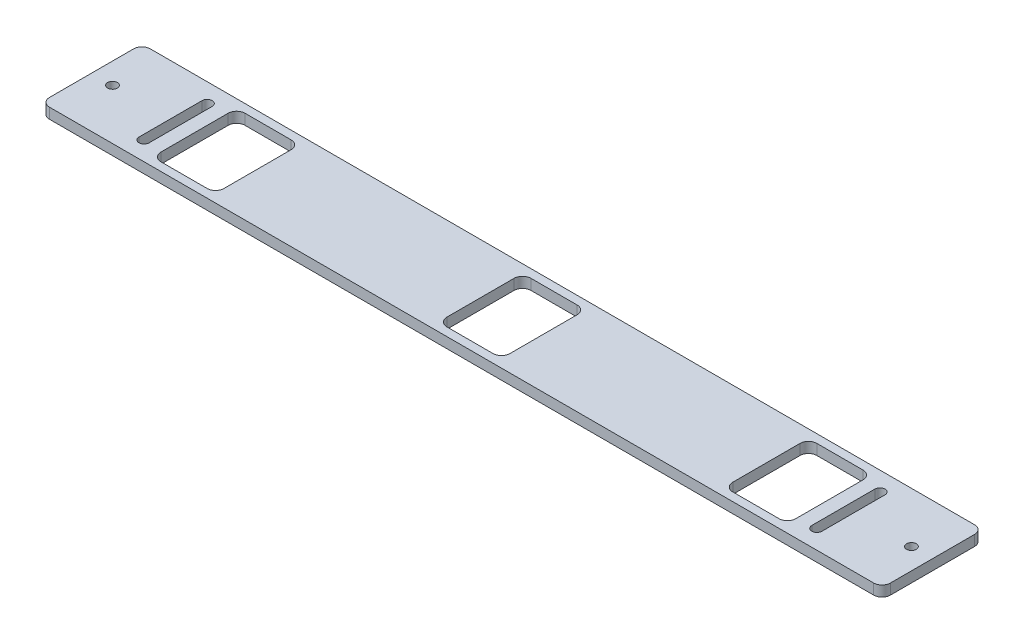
ISO-10303-21;
HEADER;
FILE_DESCRIPTION(('STEP AP214'),'2;1');
FILE_NAME('part.step','',(''),(''),'','','');
FILE_SCHEMA(('AUTOMOTIVE_DESIGN { 1 0 10303 214 1 1 1 1 }'));
ENDSEC;
DATA;
#1=APPLICATION_CONTEXT('core data for automotive mechanical design processes');
#2=APPLICATION_PROTOCOL_DEFINITION('international standard','automotive_design',2000,#1);
#3=PRODUCT_CONTEXT('',#1,'mechanical');
#4=PRODUCT('Part','Part','',(#3));
#5=PRODUCT_RELATED_PRODUCT_CATEGORY('part','',(#4));
#6=PRODUCT_DEFINITION_FORMATION('','',#4);
#7=PRODUCT_DEFINITION_CONTEXT('part definition',#1,'design');
#8=PRODUCT_DEFINITION('design','',#6,#7);
#9=PRODUCT_DEFINITION_SHAPE('','',#8);
#10=(LENGTH_UNIT() NAMED_UNIT(*) SI_UNIT(.MILLI.,.METRE.));
#11=(NAMED_UNIT(*) PLANE_ANGLE_UNIT() SI_UNIT($,.RADIAN.));
#12=(NAMED_UNIT(*) SI_UNIT($,.STERADIAN.) SOLID_ANGLE_UNIT());
#13=UNCERTAINTY_MEASURE_WITH_UNIT(LENGTH_MEASURE(1.E-05),#10,'distance_accuracy_value','');
#14=(GEOMETRIC_REPRESENTATION_CONTEXT(3) GLOBAL_UNCERTAINTY_ASSIGNED_CONTEXT((#13)) GLOBAL_UNIT_ASSIGNED_CONTEXT((#10,
#11,#12)) REPRESENTATION_CONTEXT('',''));
#15=CARTESIAN_POINT('',(0.,0.,0.));
#16=DIRECTION('',(0.,0.,1.));
#17=DIRECTION('',(1.,0.,0.));
#18=AXIS2_PLACEMENT_3D('',#15,#16,#17);
#19=CARTESIAN_POINT('',(0.,3.175,0.));
#20=DIRECTION('',(0.,-1.,0.));
#21=DIRECTION('',(0.,0.,-1.));
#22=AXIS2_PLACEMENT_3D('',#19,#20,#21);
#23=PLANE('',#22);
#24=CARTESIAN_POINT('',(6.35,3.175,-15.24));
#25=DIRECTION('',(0.,1.,0.));
#26=DIRECTION('',(0.,0.,1.));
#27=AXIS2_PLACEMENT_3D('',#24,#25,#26);
#28=CIRCLE('',#27,1.47319999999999);
#29=CARTESIAN_POINT('',(6.35,3.175,-13.7668));
#30=VERTEX_POINT('',#29);
#31=EDGE_CURVE('E1129',#30,#30,#28,.T.);
#32=ORIENTED_EDGE('',*,*,#31,.F.);
#33=EDGE_LOOP('',(#32));
#34=FACE_BOUND('',#33,.T.);
#35=CARTESIAN_POINT('',(247.65,3.175,-15.24));
#36=DIRECTION('',(0.,1.,0.));
#37=DIRECTION('',(0.,0.,1.));
#38=AXIS2_PLACEMENT_3D('',#35,#36,#37);
#39=CIRCLE('',#38,1.47319999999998);
#40=CARTESIAN_POINT('',(247.65,3.175,-13.7668));
#41=VERTEX_POINT('',#40);
#42=EDGE_CURVE('E1131',#41,#41,#39,.T.);
#43=ORIENTED_EDGE('',*,*,#42,.F.);
#44=EDGE_LOOP('',(#43));
#45=FACE_BOUND('',#44,.T.);
#46=CARTESIAN_POINT('',(25.4,3.175,-5.715));
#47=DIRECTION('',(0.,1.,0.));
#48=DIRECTION('',(0.,0.,1.));
#49=AXIS2_PLACEMENT_3D('',#46,#47,#48);
#50=CIRCLE('',#49,1.524);
#51=CARTESIAN_POINT('',(23.876,3.175,-5.715));
#52=VERTEX_POINT('',#51);
#53=CARTESIAN_POINT('',(26.924,3.175,-5.715));
#54=VERTEX_POINT('',#53);
#55=EDGE_CURVE('E335',#52,#54,#50,.T.);
#56=ORIENTED_EDGE('',*,*,#55,.F.);
#57=DIRECTION('',(0.,0.,1.));
#58=VECTOR('',#57,1.);
#59=CARTESIAN_POINT('',(23.876,3.175,-5.715));
#60=LINE('',#59,#58);
#61=CARTESIAN_POINT('',(23.876,3.175,-24.765));
#62=VERTEX_POINT('',#61);
#63=EDGE_CURVE('E343',#62,#52,#60,.T.);
#64=ORIENTED_EDGE('',*,*,#63,.F.);
#65=CARTESIAN_POINT('',(25.4,3.175,-24.765));
#66=DIRECTION('',(0.,1.,0.));
#67=DIRECTION('',(0.,0.,1.));
#68=AXIS2_PLACEMENT_3D('',#65,#66,#67);
#69=CIRCLE('',#68,1.524);
#70=CARTESIAN_POINT('',(26.924,3.175,-24.765));
#71=VERTEX_POINT('',#70);
#72=EDGE_CURVE('E340',#71,#62,#69,.T.);
#73=ORIENTED_EDGE('',*,*,#72,.F.);
#74=DIRECTION('',(0.,0.,-1.));
#75=VECTOR('',#74,1.);
#76=CARTESIAN_POINT('',(26.924,3.175,-5.715));
#77=LINE('',#76,#75);
#78=EDGE_CURVE('E337',#54,#71,#77,.T.);
#79=ORIENTED_EDGE('',*,*,#78,.F.);
#80=EDGE_LOOP('',(#56,#64,#73,#79));
#81=FACE_BOUND('',#80,.T.);
#82=DIRECTION('',(0.,0.,1.));
#83=VECTOR('',#82,1.);
#84=CARTESIAN_POINT('',(117.475,3.175,-27.94));
#85=LINE('',#84,#83);
#86=CARTESIAN_POINT('',(117.475,3.175,-25.4));
#87=VERTEX_POINT('',#86);
#88=CARTESIAN_POINT('',(117.475,3.175,-5.08));
#89=VERTEX_POINT('',#88);
#90=EDGE_CURVE('E389',#87,#89,#85,.T.);
#91=ORIENTED_EDGE('',*,*,#90,.F.);
#92=CARTESIAN_POINT('',(120.015,3.175,-25.4));
#93=DIRECTION('',(0.,-1.,0.));
#94=DIRECTION('',(0.,0.,-1.));
#95=AXIS2_PLACEMENT_3D('',#92,#93,#94);
#96=CIRCLE('',#95,2.54);
#97=CARTESIAN_POINT('',(120.015,3.175,-27.94));
#98=VERTEX_POINT('',#97);
#99=EDGE_CURVE('E576',#87,#98,#96,.T.);
#100=ORIENTED_EDGE('',*,*,#99,.T.);
#101=DIRECTION('',(-1.,0.,0.));
#102=VECTOR('',#101,1.);
#103=CARTESIAN_POINT('',(117.475,3.175,-27.94));
#104=LINE('',#103,#102);
#105=CARTESIAN_POINT('',(133.985,3.175,-27.94));
#106=VERTEX_POINT('',#105);
#107=EDGE_CURVE('E399',#106,#98,#104,.T.);
#108=ORIENTED_EDGE('',*,*,#107,.F.);
#109=CARTESIAN_POINT('',(133.985,3.175,-25.4));
#110=DIRECTION('',(0.,-1.,0.));
#111=DIRECTION('',(0.,0.,-1.));
#112=AXIS2_PLACEMENT_3D('',#109,#110,#111);
#113=CIRCLE('',#112,2.54);
#114=CARTESIAN_POINT('',(136.525,3.175,-25.4));
#115=VERTEX_POINT('',#114);
#116=EDGE_CURVE('E572',#106,#115,#113,.T.);
#117=ORIENTED_EDGE('',*,*,#116,.T.);
#118=DIRECTION('',(0.,0.,-1.));
#119=VECTOR('',#118,1.);
#120=CARTESIAN_POINT('',(136.525,3.175,-27.94));
#121=LINE('',#120,#119);
#122=CARTESIAN_POINT('',(136.525,3.175,-5.08));
#123=VERTEX_POINT('',#122);
#124=EDGE_CURVE('E396',#123,#115,#121,.T.);
#125=ORIENTED_EDGE('',*,*,#124,.F.);
#126=CARTESIAN_POINT('',(133.985,3.175,-5.08));
#127=DIRECTION('',(0.,-1.,0.));
#128=DIRECTION('',(0.,0.,-1.));
#129=AXIS2_PLACEMENT_3D('',#126,#127,#128);
#130=CIRCLE('',#129,2.54);
#131=CARTESIAN_POINT('',(133.985,3.175,-2.54));
#132=VERTEX_POINT('',#131);
#133=EDGE_CURVE('E584',#123,#132,#130,.T.);
#134=ORIENTED_EDGE('',*,*,#133,.T.);
#135=DIRECTION('',(1.,0.,0.));
#136=VECTOR('',#135,1.);
#137=CARTESIAN_POINT('',(117.475,3.175,-2.54));
#138=LINE('',#137,#136);
#139=CARTESIAN_POINT('',(120.015,3.175,-2.54));
#140=VERTEX_POINT('',#139);
#141=EDGE_CURVE('E392',#140,#132,#138,.T.);
#142=ORIENTED_EDGE('',*,*,#141,.F.);
#143=CARTESIAN_POINT('',(120.015,3.175,-5.08));
#144=DIRECTION('',(0.,-1.,0.));
#145=DIRECTION('',(0.,0.,-1.));
#146=AXIS2_PLACEMENT_3D('',#143,#144,#145);
#147=CIRCLE('',#146,2.54);
#148=EDGE_CURVE('E580',#140,#89,#147,.T.);
#149=ORIENTED_EDGE('',*,*,#148,.T.);
#150=EDGE_LOOP('',(#91,#100,#108,#117,#125,#134,#142,#149));
#151=FACE_BOUND('',#150,.T.);
#152=DIRECTION('',(1.,0.,0.));
#153=VECTOR('',#152,1.);
#154=CARTESIAN_POINT('',(0.,3.175,0.));
#155=LINE('',#154,#153);
#156=CARTESIAN_POINT('',(2.54,3.175,0.));
#157=VERTEX_POINT('',#156);
#158=CARTESIAN_POINT('',(251.46,3.175,0.));
#159=VERTEX_POINT('',#158);
#160=EDGE_CURVE('E440',#157,#159,#155,.T.);
#161=ORIENTED_EDGE('',*,*,#160,.T.);
#162=CARTESIAN_POINT('',(251.46,3.175,-2.54));
#163=DIRECTION('',(0.,-1.,0.));
#164=DIRECTION('',(0.,0.,-1.));
#165=AXIS2_PLACEMENT_3D('',#162,#163,#164);
#166=CIRCLE('',#165,2.54);
#167=CARTESIAN_POINT('',(254.,3.175,-2.54));
#168=VERTEX_POINT('',#167);
#169=EDGE_CURVE('E484',#159,#168,#166,.F.);
#170=ORIENTED_EDGE('',*,*,#169,.T.);
#171=DIRECTION('',(0.,0.,-1.));
#172=VECTOR('',#171,1.);
#173=CARTESIAN_POINT('',(254.,3.175,0.));
#174=LINE('',#173,#172);
#175=CARTESIAN_POINT('',(254.,3.175,-27.94));
#176=VERTEX_POINT('',#175);
#177=EDGE_CURVE('E444',#168,#176,#174,.T.);
#178=ORIENTED_EDGE('',*,*,#177,.T.);
#179=CARTESIAN_POINT('',(251.46,3.175,-27.94));
#180=DIRECTION('',(0.,-1.,0.));
#181=DIRECTION('',(0.,0.,-1.));
#182=AXIS2_PLACEMENT_3D('',#179,#180,#181);
#183=CIRCLE('',#182,2.54);
#184=CARTESIAN_POINT('',(251.46,3.175,-30.48));
#185=VERTEX_POINT('',#184);
#186=EDGE_CURVE('E482',#176,#185,#183,.F.);
#187=ORIENTED_EDGE('',*,*,#186,.T.);
#188=DIRECTION('',(-1.,0.,0.));
#189=VECTOR('',#188,1.);
#190=CARTESIAN_POINT('',(0.,3.175,-30.48));
#191=LINE('',#190,#189);
#192=CARTESIAN_POINT('',(2.54,3.175,-30.48));
#193=VERTEX_POINT('',#192);
#194=EDGE_CURVE('E447',#185,#193,#191,.T.);
#195=ORIENTED_EDGE('',*,*,#194,.T.);
#196=CARTESIAN_POINT('',(2.54,3.175,-27.94));
#197=DIRECTION('',(0.,-1.,0.));
#198=DIRECTION('',(0.,0.,-1.));
#199=AXIS2_PLACEMENT_3D('',#196,#197,#198);
#200=CIRCLE('',#199,2.54);
#201=CARTESIAN_POINT('',(0.,3.175,-27.94));
#202=VERTEX_POINT('',#201);
#203=EDGE_CURVE('E478',#193,#202,#200,.F.);
#204=ORIENTED_EDGE('',*,*,#203,.T.);
#205=DIRECTION('',(0.,0.,1.));
#206=VECTOR('',#205,1.);
#207=CARTESIAN_POINT('',(0.,3.175,0.));
#208=LINE('',#207,#206);
#209=CARTESIAN_POINT('',(0.,3.175,-2.54));
#210=VERTEX_POINT('',#209);
#211=EDGE_CURVE('E437',#202,#210,#208,.T.);
#212=ORIENTED_EDGE('',*,*,#211,.T.);
#213=CARTESIAN_POINT('',(2.54,3.175,-2.54));
#214=DIRECTION('',(0.,-1.,0.));
#215=DIRECTION('',(0.,0.,-1.));
#216=AXIS2_PLACEMENT_3D('',#213,#214,#215);
#217=CIRCLE('',#216,2.54);
#218=EDGE_CURVE('E480',#210,#157,#217,.F.);
#219=ORIENTED_EDGE('',*,*,#218,.T.);
#220=EDGE_LOOP('',(#161,#170,#178,#187,#195,#204,#212,#219));
#221=FACE_BOUND('',#220,.T.);
#222=DIRECTION('',(0.,0.,1.));
#223=VECTOR('',#222,1.);
#224=CARTESIAN_POINT('',(31.115,3.175,-27.94));
#225=LINE('',#224,#223);
#226=CARTESIAN_POINT('',(31.115,3.175,-25.4));
#227=VERTEX_POINT('',#226);
#228=CARTESIAN_POINT('',(31.115,3.175,-5.08));
#229=VERTEX_POINT('',#228);
#230=EDGE_CURVE('E413',#227,#229,#225,.T.);
#231=ORIENTED_EDGE('',*,*,#230,.F.);
#232=CARTESIAN_POINT('',(33.655,3.175,-25.4));
#233=DIRECTION('',(0.,-1.,0.));
#234=DIRECTION('',(0.,0.,-1.));
#235=AXIS2_PLACEMENT_3D('',#232,#233,#234);
#236=CIRCLE('',#235,2.54);
#237=CARTESIAN_POINT('',(33.655,3.175,-27.94));
#238=VERTEX_POINT('',#237);
#239=EDGE_CURVE('E11',#227,#238,#236,.T.);
#240=ORIENTED_EDGE('',*,*,#239,.T.);
#241=DIRECTION('',(-1.,0.,0.));
#242=VECTOR('',#241,1.);
#243=CARTESIAN_POINT('',(31.115,3.175,-27.94));
#244=LINE('',#243,#242);
#245=CARTESIAN_POINT('',(47.625,3.175,-27.94));
#246=VERTEX_POINT('',#245);
#247=EDGE_CURVE('E423',#246,#238,#244,.T.);
#248=ORIENTED_EDGE('',*,*,#247,.F.);
#249=CARTESIAN_POINT('',(47.625,3.175,-25.4));
#250=DIRECTION('',(0.,-1.,0.));
#251=DIRECTION('',(0.,0.,-1.));
#252=AXIS2_PLACEMENT_3D('',#249,#250,#251);
#253=CIRCLE('',#252,2.54);
#254=CARTESIAN_POINT('',(50.165,3.175,-25.4));
#255=VERTEX_POINT('',#254);
#256=EDGE_CURVE('E596',#246,#255,#253,.T.);
#257=ORIENTED_EDGE('',*,*,#256,.T.);
#258=DIRECTION('',(0.,0.,-1.));
#259=VECTOR('',#258,1.);
#260=CARTESIAN_POINT('',(50.165,3.175,-27.94));
#261=LINE('',#260,#259);
#262=CARTESIAN_POINT('',(50.165,3.175,-5.08));
#263=VERTEX_POINT('',#262);
#264=EDGE_CURVE('E420',#263,#255,#261,.T.);
#265=ORIENTED_EDGE('',*,*,#264,.F.);
#266=CARTESIAN_POINT('',(47.625,3.175,-5.08));
#267=DIRECTION('',(0.,-1.,0.));
#268=DIRECTION('',(0.,0.,-1.));
#269=AXIS2_PLACEMENT_3D('',#266,#267,#268);
#270=CIRCLE('',#269,2.54);
#271=CARTESIAN_POINT('',(47.625,3.175,-2.54));
#272=VERTEX_POINT('',#271);
#273=EDGE_CURVE('E588',#263,#272,#270,.T.);
#274=ORIENTED_EDGE('',*,*,#273,.T.);
#275=DIRECTION('',(1.,0.,0.));
#276=VECTOR('',#275,1.);
#277=CARTESIAN_POINT('',(31.115,3.175,-2.54));
#278=LINE('',#277,#276);
#279=CARTESIAN_POINT('',(33.655,3.175,-2.54));
#280=VERTEX_POINT('',#279);
#281=EDGE_CURVE('E416',#280,#272,#278,.T.);
#282=ORIENTED_EDGE('',*,*,#281,.F.);
#283=CARTESIAN_POINT('',(33.655,3.175,-5.08));
#284=DIRECTION('',(0.,-1.,0.));
#285=DIRECTION('',(0.,0.,-1.));
#286=AXIS2_PLACEMENT_3D('',#283,#284,#285);
#287=CIRCLE('',#286,2.54);
#288=EDGE_CURVE('E592',#280,#229,#287,.T.);
#289=ORIENTED_EDGE('',*,*,#288,.T.);
#290=EDGE_LOOP('',(#231,#240,#248,#257,#265,#274,#282,#289));
#291=FACE_BOUND('',#290,.T.);
#292=DIRECTION('',(0.,0.,1.));
#293=VECTOR('',#292,1.);
#294=CARTESIAN_POINT('',(203.835,3.175,-27.94));
#295=LINE('',#294,#293);
#296=CARTESIAN_POINT('',(203.835,3.175,-25.4));
#297=VERTEX_POINT('',#296);
#298=CARTESIAN_POINT('',(203.835,3.175,-5.08));
#299=VERTEX_POINT('',#298);
#300=EDGE_CURVE('E366',#297,#299,#295,.T.);
#301=ORIENTED_EDGE('',*,*,#300,.F.);
#302=CARTESIAN_POINT('',(206.375,3.175,-25.4));
#303=DIRECTION('',(0.,-1.,0.));
#304=DIRECTION('',(0.,0.,-1.));
#305=AXIS2_PLACEMENT_3D('',#302,#303,#304);
#306=CIRCLE('',#305,2.54);
#307=CARTESIAN_POINT('',(206.375,3.175,-27.94));
#308=VERTEX_POINT('',#307);
#309=EDGE_CURVE('E557',#297,#308,#306,.T.);
#310=ORIENTED_EDGE('',*,*,#309,.T.);
#311=DIRECTION('',(-1.,0.,0.));
#312=VECTOR('',#311,1.);
#313=CARTESIAN_POINT('',(203.835,3.175,-27.94));
#314=LINE('',#313,#312);
#315=CARTESIAN_POINT('',(220.345,3.175,-27.94));
#316=VERTEX_POINT('',#315);
#317=EDGE_CURVE('E375',#316,#308,#314,.T.);
#318=ORIENTED_EDGE('',*,*,#317,.F.);
#319=CARTESIAN_POINT('',(220.345,3.175,-25.4));
#320=DIRECTION('',(0.,-1.,0.));
#321=DIRECTION('',(0.,0.,-1.));
#322=AXIS2_PLACEMENT_3D('',#319,#320,#321);
#323=CIRCLE('',#322,2.54);
#324=CARTESIAN_POINT('',(222.885,3.175,-25.4));
#325=VERTEX_POINT('',#324);
#326=EDGE_CURVE('E568',#316,#325,#323,.T.);
#327=ORIENTED_EDGE('',*,*,#326,.T.);
#328=DIRECTION('',(0.,0.,-1.));
#329=VECTOR('',#328,1.);
#330=CARTESIAN_POINT('',(222.885,3.175,-27.94));
#331=LINE('',#330,#329);
#332=CARTESIAN_POINT('',(222.885,3.175,-5.08));
#333=VERTEX_POINT('',#332);
#334=EDGE_CURVE('E372',#333,#325,#331,.T.);
#335=ORIENTED_EDGE('',*,*,#334,.F.);
#336=CARTESIAN_POINT('',(220.345,3.175,-5.08));
#337=DIRECTION('',(0.,-1.,0.));
#338=DIRECTION('',(0.,0.,-1.));
#339=AXIS2_PLACEMENT_3D('',#336,#337,#338);
#340=CIRCLE('',#339,2.54);
#341=CARTESIAN_POINT('',(220.345,3.175,-2.54));
#342=VERTEX_POINT('',#341);
#343=EDGE_CURVE('E48',#333,#342,#340,.T.);
#344=ORIENTED_EDGE('',*,*,#343,.T.);
#345=DIRECTION('',(1.,0.,0.));
#346=VECTOR('',#345,1.);
#347=CARTESIAN_POINT('',(203.835,3.175,-2.54));
#348=LINE('',#347,#346);
#349=CARTESIAN_POINT('',(206.375,3.175,-2.54));
#350=VERTEX_POINT('',#349);
#351=EDGE_CURVE('E369',#350,#342,#348,.T.);
#352=ORIENTED_EDGE('',*,*,#351,.F.);
#353=CARTESIAN_POINT('',(206.375,3.175,-5.08));
#354=DIRECTION('',(0.,-1.,0.));
#355=DIRECTION('',(0.,0.,-1.));
#356=AXIS2_PLACEMENT_3D('',#353,#354,#355);
#357=CIRCLE('',#356,2.54);
#358=EDGE_CURVE('E561',#350,#299,#357,.T.);
#359=ORIENTED_EDGE('',*,*,#358,.T.);
#360=EDGE_LOOP('',(#301,#310,#318,#327,#335,#344,#352,#359));
#361=FACE_BOUND('',#360,.T.);
#362=CARTESIAN_POINT('',(228.6,3.175,-5.71500000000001));
#363=DIRECTION('',(0.,1.,0.));
#364=DIRECTION('',(0.,0.,-1.));
#365=AXIS2_PLACEMENT_3D('',#362,#363,#364);
#366=CIRCLE('',#365,1.524);
#367=CARTESIAN_POINT('',(227.076,3.175,-5.71500000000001));
#368=VERTEX_POINT('',#367);
#369=CARTESIAN_POINT('',(230.124,3.175,-5.71500000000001));
#370=VERTEX_POINT('',#369);
#371=EDGE_CURVE('E292',#368,#370,#366,.T.);
#372=ORIENTED_EDGE('',*,*,#371,.F.);
#373=DIRECTION('',(0.,0.,1.));
#374=VECTOR('',#373,1.);
#375=CARTESIAN_POINT('',(227.076,3.175,-5.71500000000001));
#376=LINE('',#375,#374);
#377=CARTESIAN_POINT('',(227.076,3.175,-24.765));
#378=VERTEX_POINT('',#377);
#379=EDGE_CURVE('E317',#378,#368,#376,.T.);
#380=ORIENTED_EDGE('',*,*,#379,.F.);
#381=CARTESIAN_POINT('',(228.6,3.175,-24.765));
#382=DIRECTION('',(0.,1.,0.));
#383=DIRECTION('',(0.,0.,-1.));
#384=AXIS2_PLACEMENT_3D('',#381,#382,#383);
#385=CIRCLE('',#384,1.524);
#386=CARTESIAN_POINT('',(230.124,3.175,-24.765));
#387=VERTEX_POINT('',#386);
#388=EDGE_CURVE('E315',#387,#378,#385,.T.);
#389=ORIENTED_EDGE('',*,*,#388,.F.);
#390=DIRECTION('',(0.,0.,-1.));
#391=VECTOR('',#390,1.);
#392=CARTESIAN_POINT('',(230.124,3.175,-5.71500000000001));
#393=LINE('',#392,#391);
#394=EDGE_CURVE('E302',#370,#387,#393,.T.);
#395=ORIENTED_EDGE('',*,*,#394,.F.);
#396=EDGE_LOOP('',(#372,#380,#389,#395));
#397=FACE_BOUND('',#396,.T.);
#398=ADVANCED_FACE('F33',(#34,#45,#81,#151,#221,#291,#361,#397),#23,.F.);
#399=CARTESIAN_POINT('',(0.,0.,0.));
#400=DIRECTION('',(0.,-1.,0.));
#401=DIRECTION('',(0.,0.,-1.));
#402=AXIS2_PLACEMENT_3D('',#399,#400,#401);
#403=PLANE('',#402);
#404=CARTESIAN_POINT('',(6.35,0.,-15.24));
#405=DIRECTION('',(0.,1.,0.));
#406=DIRECTION('',(0.,0.,1.));
#407=AXIS2_PLACEMENT_3D('',#404,#405,#406);
#408=CIRCLE('',#407,1.4732);
#409=CARTESIAN_POINT('',(6.35,0.,-13.7668));
#410=VERTEX_POINT('',#409);
#411=EDGE_CURVE('E1127',#410,#410,#408,.T.);
#412=ORIENTED_EDGE('',*,*,#411,.T.);
#413=EDGE_LOOP('',(#412));
#414=FACE_BOUND('',#413,.T.);
#415=CARTESIAN_POINT('',(247.65,0.,-15.24));
#416=DIRECTION('',(0.,1.,0.));
#417=DIRECTION('',(0.,0.,1.));
#418=AXIS2_PLACEMENT_3D('',#415,#416,#417);
#419=CIRCLE('',#418,1.47320000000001);
#420=CARTESIAN_POINT('',(247.65,0.,-13.7668));
#421=VERTEX_POINT('',#420);
#422=EDGE_CURVE('E324',#421,#421,#419,.T.);
#423=ORIENTED_EDGE('',*,*,#422,.T.);
#424=EDGE_LOOP('',(#423));
#425=FACE_BOUND('',#424,.T.);
#426=DIRECTION('',(0.,0.,1.));
#427=VECTOR('',#426,1.);
#428=CARTESIAN_POINT('',(23.876,0.,-5.715));
#429=LINE('',#428,#427);
#430=CARTESIAN_POINT('',(23.876,0.,-24.765));
#431=VERTEX_POINT('',#430);
#432=CARTESIAN_POINT('',(23.876,0.,-5.715));
#433=VERTEX_POINT('',#432);
#434=EDGE_CURVE('E338',#431,#433,#429,.T.);
#435=ORIENTED_EDGE('',*,*,#434,.T.);
#436=CARTESIAN_POINT('',(25.4,0.,-5.715));
#437=DIRECTION('',(0.,1.,0.));
#438=DIRECTION('',(0.,0.,1.));
#439=AXIS2_PLACEMENT_3D('',#436,#437,#438);
#440=CIRCLE('',#439,1.524);
#441=CARTESIAN_POINT('',(26.924,0.,-5.715));
#442=VERTEX_POINT('',#441);
#443=EDGE_CURVE('E310',#433,#442,#440,.T.);
#444=ORIENTED_EDGE('',*,*,#443,.T.);
#445=DIRECTION('',(0.,0.,-1.));
#446=VECTOR('',#445,1.);
#447=CARTESIAN_POINT('',(26.924,0.,-5.715));
#448=LINE('',#447,#446);
#449=CARTESIAN_POINT('',(26.924,0.,-24.765));
#450=VERTEX_POINT('',#449);
#451=EDGE_CURVE('E348',#442,#450,#448,.T.);
#452=ORIENTED_EDGE('',*,*,#451,.T.);
#453=CARTESIAN_POINT('',(25.4,0.,-24.765));
#454=DIRECTION('',(0.,1.,0.));
#455=DIRECTION('',(0.,0.,1.));
#456=AXIS2_PLACEMENT_3D('',#453,#454,#455);
#457=CIRCLE('',#456,1.524);
#458=EDGE_CURVE('E351',#450,#431,#457,.T.);
#459=ORIENTED_EDGE('',*,*,#458,.T.);
#460=EDGE_LOOP('',(#435,#444,#452,#459));
#461=FACE_BOUND('',#460,.T.);
#462=DIRECTION('',(0.,0.,-1.));
#463=VECTOR('',#462,1.);
#464=CARTESIAN_POINT('',(136.525,0.,-27.94));
#465=LINE('',#464,#463);
#466=CARTESIAN_POINT('',(136.525,0.,-5.08));
#467=VERTEX_POINT('',#466);
#468=CARTESIAN_POINT('',(136.525,0.,-25.4));
#469=VERTEX_POINT('',#468);
#470=EDGE_CURVE('E408',#467,#469,#465,.T.);
#471=ORIENTED_EDGE('',*,*,#470,.T.);
#472=CARTESIAN_POINT('',(133.985,0.,-25.4));
#473=DIRECTION('',(0.,-1.,0.));
#474=DIRECTION('',(0.,0.,-1.));
#475=AXIS2_PLACEMENT_3D('',#472,#473,#474);
#476=CIRCLE('',#475,2.54);
#477=CARTESIAN_POINT('',(133.985,0.,-27.94));
#478=VERTEX_POINT('',#477);
#479=EDGE_CURVE('E570',#469,#478,#476,.F.);
#480=ORIENTED_EDGE('',*,*,#479,.T.);
#481=DIRECTION('',(-1.,0.,0.));
#482=VECTOR('',#481,1.);
#483=CARTESIAN_POINT('',(117.475,0.,-27.94));
#484=LINE('',#483,#482);
#485=CARTESIAN_POINT('',(120.015,0.,-27.94));
#486=VERTEX_POINT('',#485);
#487=EDGE_CURVE('E393',#478,#486,#484,.T.);
#488=ORIENTED_EDGE('',*,*,#487,.T.);
#489=CARTESIAN_POINT('',(120.015,0.,-25.4));
#490=DIRECTION('',(0.,-1.,0.));
#491=DIRECTION('',(0.,0.,-1.));
#492=AXIS2_PLACEMENT_3D('',#489,#490,#491);
#493=CIRCLE('',#492,2.54);
#494=CARTESIAN_POINT('',(117.475,0.,-25.4));
#495=VERTEX_POINT('',#494);
#496=EDGE_CURVE('E574',#486,#495,#493,.F.);
#497=ORIENTED_EDGE('',*,*,#496,.T.);
#498=DIRECTION('',(0.,0.,1.));
#499=VECTOR('',#498,1.);
#500=CARTESIAN_POINT('',(117.475,0.,-27.94));
#501=LINE('',#500,#499);
#502=CARTESIAN_POINT('',(117.475,0.,-5.08));
#503=VERTEX_POINT('',#502);
#504=EDGE_CURVE('E378',#495,#503,#501,.T.);
#505=ORIENTED_EDGE('',*,*,#504,.T.);
#506=CARTESIAN_POINT('',(120.015,0.,-5.08));
#507=DIRECTION('',(0.,-1.,0.));
#508=DIRECTION('',(0.,0.,-1.));
#509=AXIS2_PLACEMENT_3D('',#506,#507,#508);
#510=CIRCLE('',#509,2.54);
#511=CARTESIAN_POINT('',(120.015,0.,-2.54));
#512=VERTEX_POINT('',#511);
#513=EDGE_CURVE('E578',#503,#512,#510,.F.);
#514=ORIENTED_EDGE('',*,*,#513,.T.);
#515=DIRECTION('',(1.,0.,0.));
#516=VECTOR('',#515,1.);
#517=CARTESIAN_POINT('',(117.475,0.,-2.54));
#518=LINE('',#517,#516);
#519=CARTESIAN_POINT('',(133.985,0.,-2.54));
#520=VERTEX_POINT('',#519);
#521=EDGE_CURVE('E405',#512,#520,#518,.T.);
#522=ORIENTED_EDGE('',*,*,#521,.T.);
#523=CARTESIAN_POINT('',(133.985,0.,-5.08));
#524=DIRECTION('',(0.,-1.,0.));
#525=DIRECTION('',(0.,0.,-1.));
#526=AXIS2_PLACEMENT_3D('',#523,#524,#525);
#527=CIRCLE('',#526,2.54);
#528=EDGE_CURVE('E582',#520,#467,#527,.F.);
#529=ORIENTED_EDGE('',*,*,#528,.T.);
#530=EDGE_LOOP('',(#471,#480,#488,#497,#505,#514,#522,#529));
#531=FACE_BOUND('',#530,.T.);
#532=DIRECTION('',(0.,0.,-1.));
#533=VECTOR('',#532,1.);
#534=CARTESIAN_POINT('',(254.,0.,0.));
#535=LINE('',#534,#533);
#536=CARTESIAN_POINT('',(254.,0.,-2.54));
#537=VERTEX_POINT('',#536);
#538=CARTESIAN_POINT('',(254.,0.,-27.94));
#539=VERTEX_POINT('',#538);
#540=EDGE_CURVE('E456',#537,#539,#535,.T.);
#541=ORIENTED_EDGE('',*,*,#540,.F.);
#542=CARTESIAN_POINT('',(251.46,0.,-2.54));
#543=DIRECTION('',(0.,-1.,0.));
#544=DIRECTION('',(0.,0.,-1.));
#545=AXIS2_PLACEMENT_3D('',#542,#543,#544);
#546=CIRCLE('',#545,2.54);
#547=CARTESIAN_POINT('',(251.46,0.,0.));
#548=VERTEX_POINT('',#547);
#549=EDGE_CURVE('E471',#537,#548,#546,.T.);
#550=ORIENTED_EDGE('',*,*,#549,.T.);
#551=DIRECTION('',(1.,0.,0.));
#552=VECTOR('',#551,1.);
#553=CARTESIAN_POINT('',(0.,0.,0.));
#554=LINE('',#553,#552);
#555=CARTESIAN_POINT('',(2.54,0.,0.));
#556=VERTEX_POINT('',#555);
#557=EDGE_CURVE('E453',#556,#548,#554,.T.);
#558=ORIENTED_EDGE('',*,*,#557,.F.);
#559=CARTESIAN_POINT('',(2.54,0.,-2.54));
#560=DIRECTION('',(0.,-1.,0.));
#561=DIRECTION('',(0.,0.,-1.));
#562=AXIS2_PLACEMENT_3D('',#559,#560,#561);
#563=CIRCLE('',#562,2.54);
#564=CARTESIAN_POINT('',(0.,0.,-2.54));
#565=VERTEX_POINT('',#564);
#566=EDGE_CURVE('E467',#556,#565,#563,.T.);
#567=ORIENTED_EDGE('',*,*,#566,.T.);
#568=DIRECTION('',(0.,0.,1.));
#569=VECTOR('',#568,1.);
#570=CARTESIAN_POINT('',(0.,0.,0.));
#571=LINE('',#570,#569);
#572=CARTESIAN_POINT('',(0.,0.,-27.94));
#573=VERTEX_POINT('',#572);
#574=EDGE_CURVE('E426',#573,#565,#571,.T.);
#575=ORIENTED_EDGE('',*,*,#574,.F.);
#576=CARTESIAN_POINT('',(2.54,0.,-27.94));
#577=DIRECTION('',(0.,-1.,0.));
#578=DIRECTION('',(0.,0.,-1.));
#579=AXIS2_PLACEMENT_3D('',#576,#577,#578);
#580=CIRCLE('',#579,2.54);
#581=CARTESIAN_POINT('',(2.54,0.,-30.48));
#582=VERTEX_POINT('',#581);
#583=EDGE_CURVE('E465',#573,#582,#580,.T.);
#584=ORIENTED_EDGE('',*,*,#583,.T.);
#585=DIRECTION('',(-1.,0.,0.));
#586=VECTOR('',#585,1.);
#587=CARTESIAN_POINT('',(0.,0.,-30.48));
#588=LINE('',#587,#586);
#589=CARTESIAN_POINT('',(251.46,0.,-30.48));
#590=VERTEX_POINT('',#589);
#591=EDGE_CURVE('E441',#590,#582,#588,.T.);
#592=ORIENTED_EDGE('',*,*,#591,.F.);
#593=CARTESIAN_POINT('',(251.46,0.,-27.94));
#594=DIRECTION('',(0.,-1.,0.));
#595=DIRECTION('',(0.,0.,-1.));
#596=AXIS2_PLACEMENT_3D('',#593,#594,#595);
#597=CIRCLE('',#596,2.54);
#598=EDGE_CURVE('E469',#590,#539,#597,.T.);
#599=ORIENTED_EDGE('',*,*,#598,.T.);
#600=EDGE_LOOP('',(#541,#550,#558,#567,#575,#584,#592,#599));
#601=FACE_BOUND('',#600,.T.);
#602=DIRECTION('',(0.,0.,-1.));
#603=VECTOR('',#602,1.);
#604=CARTESIAN_POINT('',(50.165,0.,-27.94));
#605=LINE('',#604,#603);
#606=CARTESIAN_POINT('',(50.165,0.,-5.08));
#607=VERTEX_POINT('',#606);
#608=CARTESIAN_POINT('',(50.165,0.,-25.4));
#609=VERTEX_POINT('',#608);
#610=EDGE_CURVE('E432',#607,#609,#605,.T.);
#611=ORIENTED_EDGE('',*,*,#610,.T.);
#612=CARTESIAN_POINT('',(47.625,0.,-25.4));
#613=DIRECTION('',(0.,-1.,0.));
#614=DIRECTION('',(0.,0.,-1.));
#615=AXIS2_PLACEMENT_3D('',#612,#613,#614);
#616=CIRCLE('',#615,2.54);
#617=CARTESIAN_POINT('',(47.625,0.,-27.94));
#618=VERTEX_POINT('',#617);
#619=EDGE_CURVE('E594',#609,#618,#616,.F.);
#620=ORIENTED_EDGE('',*,*,#619,.T.);
#621=DIRECTION('',(-1.,0.,0.));
#622=VECTOR('',#621,1.);
#623=CARTESIAN_POINT('',(31.115,0.,-27.94));
#624=LINE('',#623,#622);
#625=CARTESIAN_POINT('',(33.655,0.,-27.94));
#626=VERTEX_POINT('',#625);
#627=EDGE_CURVE('E417',#618,#626,#624,.T.);
#628=ORIENTED_EDGE('',*,*,#627,.T.);
#629=CARTESIAN_POINT('',(33.655,0.,-25.4));
#630=DIRECTION('',(0.,-1.,0.));
#631=DIRECTION('',(0.,0.,-1.));
#632=AXIS2_PLACEMENT_3D('',#629,#630,#631);
#633=CIRCLE('',#632,2.54);
#634=CARTESIAN_POINT('',(31.115,0.,-25.4));
#635=VERTEX_POINT('',#634);
#636=EDGE_CURVE('E41',#626,#635,#633,.F.);
#637=ORIENTED_EDGE('',*,*,#636,.T.);
#638=DIRECTION('',(0.,0.,1.));
#639=VECTOR('',#638,1.);
#640=CARTESIAN_POINT('',(31.115,0.,-27.94));
#641=LINE('',#640,#639);
#642=CARTESIAN_POINT('',(31.115,0.,-5.08));
#643=VERTEX_POINT('',#642);
#644=EDGE_CURVE('E402',#635,#643,#641,.T.);
#645=ORIENTED_EDGE('',*,*,#644,.T.);
#646=CARTESIAN_POINT('',(33.655,0.,-5.08));
#647=DIRECTION('',(0.,-1.,0.));
#648=DIRECTION('',(0.,0.,-1.));
#649=AXIS2_PLACEMENT_3D('',#646,#647,#648);
#650=CIRCLE('',#649,2.54);
#651=CARTESIAN_POINT('',(33.655,0.,-2.54));
#652=VERTEX_POINT('',#651);
#653=EDGE_CURVE('E590',#643,#652,#650,.F.);
#654=ORIENTED_EDGE('',*,*,#653,.T.);
#655=DIRECTION('',(1.,0.,0.));
#656=VECTOR('',#655,1.);
#657=CARTESIAN_POINT('',(31.115,0.,-2.54));
#658=LINE('',#657,#656);
#659=CARTESIAN_POINT('',(47.625,0.,-2.54));
#660=VERTEX_POINT('',#659);
#661=EDGE_CURVE('E429',#652,#660,#658,.T.);
#662=ORIENTED_EDGE('',*,*,#661,.T.);
#663=CARTESIAN_POINT('',(47.625,0.,-5.08));
#664=DIRECTION('',(0.,-1.,0.));
#665=DIRECTION('',(0.,0.,-1.));
#666=AXIS2_PLACEMENT_3D('',#663,#664,#665);
#667=CIRCLE('',#666,2.54);
#668=EDGE_CURVE('E586',#660,#607,#667,.F.);
#669=ORIENTED_EDGE('',*,*,#668,.T.);
#670=EDGE_LOOP('',(#611,#620,#628,#637,#645,#654,#662,#669));
#671=FACE_BOUND('',#670,.T.);
#672=DIRECTION('',(0.,0.,-1.));
#673=VECTOR('',#672,1.);
#674=CARTESIAN_POINT('',(222.885,0.,-27.94));
#675=LINE('',#674,#673);
#676=CARTESIAN_POINT('',(222.885,0.,-5.08));
#677=VERTEX_POINT('',#676);
#678=CARTESIAN_POINT('',(222.885,0.,-25.4));
#679=VERTEX_POINT('',#678);
#680=EDGE_CURVE('E384',#677,#679,#675,.T.);
#681=ORIENTED_EDGE('',*,*,#680,.T.);
#682=CARTESIAN_POINT('',(220.345,0.,-25.4));
#683=DIRECTION('',(0.,-1.,0.));
#684=DIRECTION('',(0.,0.,-1.));
#685=AXIS2_PLACEMENT_3D('',#682,#683,#684);
#686=CIRCLE('',#685,2.54);
#687=CARTESIAN_POINT('',(220.345,0.,-27.94));
#688=VERTEX_POINT('',#687);
#689=EDGE_CURVE('E566',#679,#688,#686,.F.);
#690=ORIENTED_EDGE('',*,*,#689,.T.);
#691=DIRECTION('',(-1.,0.,0.));
#692=VECTOR('',#691,1.);
#693=CARTESIAN_POINT('',(203.835,0.,-27.94));
#694=LINE('',#693,#692);
#695=CARTESIAN_POINT('',(206.375,0.,-27.94));
#696=VERTEX_POINT('',#695);
#697=EDGE_CURVE('E370',#688,#696,#694,.T.);
#698=ORIENTED_EDGE('',*,*,#697,.T.);
#699=CARTESIAN_POINT('',(206.375,0.,-25.4));
#700=DIRECTION('',(0.,-1.,0.));
#701=DIRECTION('',(0.,0.,-1.));
#702=AXIS2_PLACEMENT_3D('',#699,#700,#701);
#703=CIRCLE('',#702,2.54);
#704=CARTESIAN_POINT('',(203.835,0.,-25.4));
#705=VERTEX_POINT('',#704);
#706=EDGE_CURVE('E555',#696,#705,#703,.F.);
#707=ORIENTED_EDGE('',*,*,#706,.T.);
#708=DIRECTION('',(0.,0.,1.));
#709=VECTOR('',#708,1.);
#710=CARTESIAN_POINT('',(203.835,0.,-27.94));
#711=LINE('',#710,#709);
#712=CARTESIAN_POINT('',(203.835,0.,-5.08));
#713=VERTEX_POINT('',#712);
#714=EDGE_CURVE('E365',#705,#713,#711,.T.);
#715=ORIENTED_EDGE('',*,*,#714,.T.);
#716=CARTESIAN_POINT('',(206.375,0.,-5.08));
#717=DIRECTION('',(0.,-1.,0.));
#718=DIRECTION('',(0.,0.,-1.));
#719=AXIS2_PLACEMENT_3D('',#716,#717,#718);
#720=CIRCLE('',#719,2.54);
#721=CARTESIAN_POINT('',(206.375,0.,-2.54));
#722=VERTEX_POINT('',#721);
#723=EDGE_CURVE('E559',#713,#722,#720,.F.);
#724=ORIENTED_EDGE('',*,*,#723,.T.);
#725=DIRECTION('',(1.,0.,0.));
#726=VECTOR('',#725,1.);
#727=CARTESIAN_POINT('',(203.835,0.,-2.54));
#728=LINE('',#727,#726);
#729=CARTESIAN_POINT('',(220.345,0.,-2.54));
#730=VERTEX_POINT('',#729);
#731=EDGE_CURVE('E381',#722,#730,#728,.T.);
#732=ORIENTED_EDGE('',*,*,#731,.T.);
#733=CARTESIAN_POINT('',(220.345,0.,-5.08));
#734=DIRECTION('',(0.,-1.,0.));
#735=DIRECTION('',(0.,0.,-1.));
#736=AXIS2_PLACEMENT_3D('',#733,#734,#735);
#737=CIRCLE('',#736,2.54);
#738=EDGE_CURVE('E563',#730,#677,#737,.F.);
#739=ORIENTED_EDGE('',*,*,#738,.T.);
#740=EDGE_LOOP('',(#681,#690,#698,#707,#715,#724,#732,#739));
#741=FACE_BOUND('',#740,.T.);
#742=DIRECTION('',(0.,0.,1.));
#743=VECTOR('',#742,1.);
#744=CARTESIAN_POINT('',(227.076,0.,-5.71500000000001));
#745=LINE('',#744,#743);
#746=CARTESIAN_POINT('',(227.076,0.,-24.765));
#747=VERTEX_POINT('',#746);
#748=CARTESIAN_POINT('',(227.076,0.,-5.71500000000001));
#749=VERTEX_POINT('',#748);
#750=EDGE_CURVE('E303',#747,#749,#745,.T.);
#751=ORIENTED_EDGE('',*,*,#750,.T.);
#752=CARTESIAN_POINT('',(228.6,0.,-5.71500000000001));
#753=DIRECTION('',(0.,1.,0.));
#754=DIRECTION('',(0.,0.,-1.));
#755=AXIS2_PLACEMENT_3D('',#752,#753,#754);
#756=CIRCLE('',#755,1.524);
#757=CARTESIAN_POINT('',(230.124,0.,-5.71500000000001));
#758=VERTEX_POINT('',#757);
#759=EDGE_CURVE('E322',#749,#758,#756,.T.);
#760=ORIENTED_EDGE('',*,*,#759,.T.);
#761=DIRECTION('',(0.,0.,-1.));
#762=VECTOR('',#761,1.);
#763=CARTESIAN_POINT('',(230.124,0.,-5.71500000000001));
#764=LINE('',#763,#762);
#765=CARTESIAN_POINT('',(230.124,0.,-24.765));
#766=VERTEX_POINT('',#765);
#767=EDGE_CURVE('E309',#758,#766,#764,.T.);
#768=ORIENTED_EDGE('',*,*,#767,.T.);
#769=CARTESIAN_POINT('',(228.6,0.,-24.765));
#770=DIRECTION('',(0.,1.,0.));
#771=DIRECTION('',(0.,0.,-1.));
#772=AXIS2_PLACEMENT_3D('',#769,#770,#771);
#773=CIRCLE('',#772,1.524);
#774=EDGE_CURVE('E326',#766,#747,#773,.T.);
#775=ORIENTED_EDGE('',*,*,#774,.T.);
#776=EDGE_LOOP('',(#751,#760,#768,#775));
#777=FACE_BOUND('',#776,.T.);
#778=ADVANCED_FACE('F599',(#414,#425,#461,#531,#601,#671,#741,#777),#403,.T.);
#779=CARTESIAN_POINT('',(0.,3.175,0.));
#780=DIRECTION('',(1.,0.,0.));
#781=DIRECTION('',(0.,0.,-1.));
#782=AXIS2_PLACEMENT_3D('',#779,#780,#781);
#783=PLANE('',#782);
#784=ORIENTED_EDGE('',*,*,#574,.T.);
#785=DIRECTION('',(0.,-1.,0.));
#786=VECTOR('',#785,1.);
#787=CARTESIAN_POINT('',(0.,3.175,-2.54));
#788=LINE('',#787,#786);
#789=EDGE_CURVE('E494',#565,#210,#788,.F.);
#790=ORIENTED_EDGE('',*,*,#789,.T.);
#791=ORIENTED_EDGE('',*,*,#211,.F.);
#792=DIRECTION('',(0.,-1.,0.));
#793=VECTOR('',#792,1.);
#794=CARTESIAN_POINT('',(0.,3.175,-27.94));
#795=LINE('',#794,#793);
#796=EDGE_CURVE('E491',#202,#573,#795,.T.);
#797=ORIENTED_EDGE('',*,*,#796,.T.);
#798=EDGE_LOOP('',(#784,#790,#791,#797));
#799=FACE_BOUND('',#798,.T.);
#800=ADVANCED_FACE('F650',(#799),#783,.F.);
#801=CARTESIAN_POINT('',(0.,3.175,0.));
#802=DIRECTION('',(0.,0.,-1.));
#803=DIRECTION('',(-1.,0.,0.));
#804=AXIS2_PLACEMENT_3D('',#801,#802,#803);
#805=PLANE('',#804);
#806=ORIENTED_EDGE('',*,*,#557,.T.);
#807=DIRECTION('',(0.,-1.,0.));
#808=VECTOR('',#807,1.);
#809=CARTESIAN_POINT('',(251.46,3.175,0.));
#810=LINE('',#809,#808);
#811=EDGE_CURVE('E476',#548,#159,#810,.F.);
#812=ORIENTED_EDGE('',*,*,#811,.T.);
#813=ORIENTED_EDGE('',*,*,#160,.F.);
#814=DIRECTION('',(0.,-1.,0.));
#815=VECTOR('',#814,1.);
#816=CARTESIAN_POINT('',(2.54,3.175,0.));
#817=LINE('',#816,#815);
#818=EDGE_CURVE('E473',#157,#556,#817,.T.);
#819=ORIENTED_EDGE('',*,*,#818,.T.);
#820=EDGE_LOOP('',(#806,#812,#813,#819));
#821=FACE_BOUND('',#820,.T.);
#822=ADVANCED_FACE('F665',(#821),#805,.F.);
#823=CARTESIAN_POINT('',(254.,3.175,0.));
#824=DIRECTION('',(-1.,0.,0.));
#825=DIRECTION('',(0.,0.,1.));
#826=AXIS2_PLACEMENT_3D('',#823,#824,#825);
#827=PLANE('',#826);
#828=ORIENTED_EDGE('',*,*,#177,.F.);
#829=DIRECTION('',(0.,-1.,0.));
#830=VECTOR('',#829,1.);
#831=CARTESIAN_POINT('',(254.,3.175,-2.54));
#832=LINE('',#831,#830);
#833=EDGE_CURVE('E462',#168,#537,#832,.T.);
#834=ORIENTED_EDGE('',*,*,#833,.T.);
#835=ORIENTED_EDGE('',*,*,#540,.T.);
#836=DIRECTION('',(0.,-1.,0.));
#837=VECTOR('',#836,1.);
#838=CARTESIAN_POINT('',(254.,3.175,-27.94));
#839=LINE('',#838,#837);
#840=EDGE_CURVE('E450',#539,#176,#839,.F.);
#841=ORIENTED_EDGE('',*,*,#840,.T.);
#842=EDGE_LOOP('',(#828,#834,#835,#841));
#843=FACE_BOUND('',#842,.T.);
#844=ADVANCED_FACE('F661',(#843),#827,.F.);
#845=CARTESIAN_POINT('',(0.,3.175,-30.48));
#846=DIRECTION('',(0.,0.,1.));
#847=DIRECTION('',(1.,0.,0.));
#848=AXIS2_PLACEMENT_3D('',#845,#846,#847);
#849=PLANE('',#848);
#850=ORIENTED_EDGE('',*,*,#194,.F.);
#851=DIRECTION('',(0.,-1.,0.));
#852=VECTOR('',#851,1.);
#853=CARTESIAN_POINT('',(251.46,3.175,-30.48));
#854=LINE('',#853,#852);
#855=EDGE_CURVE('E488',#185,#590,#854,.T.);
#856=ORIENTED_EDGE('',*,*,#855,.T.);
#857=ORIENTED_EDGE('',*,*,#591,.T.);
#858=DIRECTION('',(0.,-1.,0.));
#859=VECTOR('',#858,1.);
#860=CARTESIAN_POINT('',(2.54,3.175,-30.48));
#861=LINE('',#860,#859);
#862=EDGE_CURVE('E486',#582,#193,#861,.F.);
#863=ORIENTED_EDGE('',*,*,#862,.T.);
#864=EDGE_LOOP('',(#850,#856,#857,#863));
#865=FACE_BOUND('',#864,.T.);
#866=ADVANCED_FACE('F658',(#865),#849,.F.);
#867=CARTESIAN_POINT('',(31.115,3.175,-27.94));
#868=DIRECTION('',(1.,0.,0.));
#869=DIRECTION('',(0.,0.,-1.));
#870=AXIS2_PLACEMENT_3D('',#867,#868,#869);
#871=PLANE('',#870);
#872=ORIENTED_EDGE('',*,*,#230,.T.);
#873=DIRECTION('',(0.,-1.,0.));
#874=VECTOR('',#873,1.);
#875=CARTESIAN_POINT('',(31.115,0.,-5.08));
#876=LINE('',#875,#874);
#877=EDGE_CURVE('E547',#229,#643,#876,.T.);
#878=ORIENTED_EDGE('',*,*,#877,.T.);
#879=ORIENTED_EDGE('',*,*,#644,.F.);
#880=DIRECTION('',(0.,-1.,0.));
#881=VECTOR('',#880,1.);
#882=CARTESIAN_POINT('',(31.115,3.175,-25.4));
#883=LINE('',#882,#881);
#884=EDGE_CURVE('E545',#635,#227,#883,.F.);
#885=ORIENTED_EDGE('',*,*,#884,.T.);
#886=EDGE_LOOP('',(#872,#878,#879,#885));
#887=FACE_BOUND('',#886,.T.);
#888=ADVANCED_FACE('F606',(#887),#871,.T.);
#889=CARTESIAN_POINT('',(31.115,3.175,-2.54));
#890=DIRECTION('',(0.,0.,-1.));
#891=DIRECTION('',(-1.,0.,0.));
#892=AXIS2_PLACEMENT_3D('',#889,#890,#891);
#893=PLANE('',#892);
#894=ORIENTED_EDGE('',*,*,#281,.T.);
#895=DIRECTION('',(0.,-1.,0.));
#896=VECTOR('',#895,1.);
#897=CARTESIAN_POINT('',(47.625,0.,-2.54));
#898=LINE('',#897,#896);
#899=EDGE_CURVE('E537',#272,#660,#898,.T.);
#900=ORIENTED_EDGE('',*,*,#899,.T.);
#901=ORIENTED_EDGE('',*,*,#661,.F.);
#902=DIRECTION('',(0.,-1.,0.));
#903=VECTOR('',#902,1.);
#904=CARTESIAN_POINT('',(33.655,3.175,-2.54));
#905=LINE('',#904,#903);
#906=EDGE_CURVE('E535',#652,#280,#905,.F.);
#907=ORIENTED_EDGE('',*,*,#906,.T.);
#908=EDGE_LOOP('',(#894,#900,#901,#907));
#909=FACE_BOUND('',#908,.T.);
#910=ADVANCED_FACE('F631',(#909),#893,.T.);
#911=CARTESIAN_POINT('',(50.165,3.175,-27.94));
#912=DIRECTION('',(-1.,0.,0.));
#913=DIRECTION('',(0.,0.,1.));
#914=AXIS2_PLACEMENT_3D('',#911,#912,#913);
#915=PLANE('',#914);
#916=ORIENTED_EDGE('',*,*,#610,.F.);
#917=DIRECTION('',(0.,-1.,0.));
#918=VECTOR('',#917,1.);
#919=CARTESIAN_POINT('',(50.165,3.175,-5.08));
#920=LINE('',#919,#918);
#921=EDGE_CURVE('E543',#607,#263,#920,.F.);
#922=ORIENTED_EDGE('',*,*,#921,.T.);
#923=ORIENTED_EDGE('',*,*,#264,.T.);
#924=DIRECTION('',(0.,-1.,0.));
#925=VECTOR('',#924,1.);
#926=CARTESIAN_POINT('',(50.165,0.,-25.4));
#927=LINE('',#926,#925);
#928=EDGE_CURVE('E540',#255,#609,#927,.T.);
#929=ORIENTED_EDGE('',*,*,#928,.T.);
#930=EDGE_LOOP('',(#916,#922,#923,#929));
#931=FACE_BOUND('',#930,.T.);
#932=ADVANCED_FACE('F623',(#931),#915,.T.);
#933=CARTESIAN_POINT('',(31.115,3.175,-27.94));
#934=DIRECTION('',(0.,0.,1.));
#935=DIRECTION('',(1.,0.,0.));
#936=AXIS2_PLACEMENT_3D('',#933,#934,#935);
#937=PLANE('',#936);
#938=ORIENTED_EDGE('',*,*,#627,.F.);
#939=DIRECTION('',(0.,-1.,0.));
#940=VECTOR('',#939,1.);
#941=CARTESIAN_POINT('',(47.625,3.175,-27.94));
#942=LINE('',#941,#940);
#943=EDGE_CURVE('E553',#618,#246,#942,.F.);
#944=ORIENTED_EDGE('',*,*,#943,.T.);
#945=ORIENTED_EDGE('',*,*,#247,.T.);
#946=DIRECTION('',(0.,-1.,0.));
#947=VECTOR('',#946,1.);
#948=CARTESIAN_POINT('',(33.655,0.,-27.94));
#949=LINE('',#948,#947);
#950=EDGE_CURVE('E550',#238,#626,#949,.T.);
#951=ORIENTED_EDGE('',*,*,#950,.T.);
#952=EDGE_LOOP('',(#938,#944,#945,#951));
#953=FACE_BOUND('',#952,.T.);
#954=ADVANCED_FACE('F614',(#953),#937,.T.);
#955=CARTESIAN_POINT('',(117.475,3.175,-27.94));
#956=DIRECTION('',(1.,0.,0.));
#957=DIRECTION('',(0.,0.,-1.));
#958=AXIS2_PLACEMENT_3D('',#955,#956,#957);
#959=PLANE('',#958);
#960=ORIENTED_EDGE('',*,*,#504,.F.);
#961=DIRECTION('',(0.,-1.,0.));
#962=VECTOR('',#961,1.);
#963=CARTESIAN_POINT('',(117.475,3.175,-25.4));
#964=LINE('',#963,#962);
#965=EDGE_CURVE('E528',#495,#87,#964,.F.);
#966=ORIENTED_EDGE('',*,*,#965,.T.);
#967=ORIENTED_EDGE('',*,*,#90,.T.);
#968=DIRECTION('',(0.,-1.,0.));
#969=VECTOR('',#968,1.);
#970=CARTESIAN_POINT('',(117.475,0.,-5.08));
#971=LINE('',#970,#969);
#972=EDGE_CURVE('E525',#89,#503,#971,.T.);
#973=ORIENTED_EDGE('',*,*,#972,.T.);
#974=EDGE_LOOP('',(#960,#966,#967,#973));
#975=FACE_BOUND('',#974,.T.);
#976=ADVANCED_FACE('F739',(#975),#959,.T.);
#977=CARTESIAN_POINT('',(117.475,3.175,-2.54));
#978=DIRECTION('',(0.,0.,-1.));
#979=DIRECTION('',(-1.,0.,0.));
#980=AXIS2_PLACEMENT_3D('',#977,#978,#979);
#981=PLANE('',#980);
#982=ORIENTED_EDGE('',*,*,#521,.F.);
#983=DIRECTION('',(0.,-1.,0.));
#984=VECTOR('',#983,1.);
#985=CARTESIAN_POINT('',(120.015,3.175,-2.54));
#986=LINE('',#985,#984);
#987=EDGE_CURVE('E533',#512,#140,#986,.F.);
#988=ORIENTED_EDGE('',*,*,#987,.T.);
#989=ORIENTED_EDGE('',*,*,#141,.T.);
#990=DIRECTION('',(0.,-1.,0.));
#991=VECTOR('',#990,1.);
#992=CARTESIAN_POINT('',(133.985,0.,-2.54));
#993=LINE('',#992,#991);
#994=EDGE_CURVE('E530',#132,#520,#993,.T.);
#995=ORIENTED_EDGE('',*,*,#994,.T.);
#996=EDGE_LOOP('',(#982,#988,#989,#995));
#997=FACE_BOUND('',#996,.T.);
#998=ADVANCED_FACE('F733',(#997),#981,.T.);
#999=CARTESIAN_POINT('',(136.525,3.175,-27.94));
#1000=DIRECTION('',(-1.,0.,0.));
#1001=DIRECTION('',(0.,0.,1.));
#1002=AXIS2_PLACEMENT_3D('',#999,#1000,#1001);
#1003=PLANE('',#1002);
#1004=ORIENTED_EDGE('',*,*,#124,.T.);
#1005=DIRECTION('',(0.,-1.,0.));
#1006=VECTOR('',#1005,1.);
#1007=CARTESIAN_POINT('',(136.525,0.,-25.4));
#1008=LINE('',#1007,#1006);
#1009=EDGE_CURVE('E517',#115,#469,#1008,.T.);
#1010=ORIENTED_EDGE('',*,*,#1009,.T.);
#1011=ORIENTED_EDGE('',*,*,#470,.F.);
#1012=DIRECTION('',(0.,-1.,0.));
#1013=VECTOR('',#1012,1.);
#1014=CARTESIAN_POINT('',(136.525,3.175,-5.08));
#1015=LINE('',#1014,#1013);
#1016=EDGE_CURVE('E515',#467,#123,#1015,.F.);
#1017=ORIENTED_EDGE('',*,*,#1016,.T.);
#1018=EDGE_LOOP('',(#1004,#1010,#1011,#1017));
#1019=FACE_BOUND('',#1018,.T.);
#1020=ADVANCED_FACE('F750',(#1019),#1003,.T.);
#1021=CARTESIAN_POINT('',(117.475,3.175,-27.94));
#1022=DIRECTION('',(0.,0.,1.));
#1023=DIRECTION('',(1.,0.,0.));
#1024=AXIS2_PLACEMENT_3D('',#1021,#1022,#1023);
#1025=PLANE('',#1024);
#1026=ORIENTED_EDGE('',*,*,#487,.F.);
#1027=DIRECTION('',(0.,-1.,0.));
#1028=VECTOR('',#1027,1.);
#1029=CARTESIAN_POINT('',(133.985,3.175,-27.94));
#1030=LINE('',#1029,#1028);
#1031=EDGE_CURVE('E523',#478,#106,#1030,.F.);
#1032=ORIENTED_EDGE('',*,*,#1031,.T.);
#1033=ORIENTED_EDGE('',*,*,#107,.T.);
#1034=DIRECTION('',(0.,-1.,0.));
#1035=VECTOR('',#1034,1.);
#1036=CARTESIAN_POINT('',(120.015,0.,-27.94));
#1037=LINE('',#1036,#1035);
#1038=EDGE_CURVE('E520',#98,#486,#1037,.T.);
#1039=ORIENTED_EDGE('',*,*,#1038,.T.);
#1040=EDGE_LOOP('',(#1026,#1032,#1033,#1039));
#1041=FACE_BOUND('',#1040,.T.);
#1042=ADVANCED_FACE('F746',(#1041),#1025,.T.);
#1043=CARTESIAN_POINT('',(203.835,3.175,-27.94));
#1044=DIRECTION('',(1.,0.,0.));
#1045=DIRECTION('',(0.,0.,-1.));
#1046=AXIS2_PLACEMENT_3D('',#1043,#1044,#1045);
#1047=PLANE('',#1046);
#1048=ORIENTED_EDGE('',*,*,#714,.F.);
#1049=DIRECTION('',(0.,-1.,0.));
#1050=VECTOR('',#1049,1.);
#1051=CARTESIAN_POINT('',(203.835,3.175,-25.4));
#1052=LINE('',#1051,#1050);
#1053=EDGE_CURVE('E504',#705,#297,#1052,.F.);
#1054=ORIENTED_EDGE('',*,*,#1053,.T.);
#1055=ORIENTED_EDGE('',*,*,#300,.T.);
#1056=DIRECTION('',(0.,-1.,0.));
#1057=VECTOR('',#1056,1.);
#1058=CARTESIAN_POINT('',(203.835,0.,-5.08));
#1059=LINE('',#1058,#1057);
#1060=EDGE_CURVE('E501',#299,#713,#1059,.T.);
#1061=ORIENTED_EDGE('',*,*,#1060,.T.);
#1062=EDGE_LOOP('',(#1048,#1054,#1055,#1061));
#1063=FACE_BOUND('',#1062,.T.);
#1064=ADVANCED_FACE('F780',(#1063),#1047,.T.);
#1065=CARTESIAN_POINT('',(203.835,3.175,-2.54));
#1066=DIRECTION('',(0.,0.,-1.));
#1067=DIRECTION('',(-1.,0.,0.));
#1068=AXIS2_PLACEMENT_3D('',#1065,#1066,#1067);
#1069=PLANE('',#1068);
#1070=ORIENTED_EDGE('',*,*,#731,.F.);
#1071=DIRECTION('',(0.,-1.,0.));
#1072=VECTOR('',#1071,1.);
#1073=CARTESIAN_POINT('',(206.375,3.175,-2.54));
#1074=LINE('',#1073,#1072);
#1075=EDGE_CURVE('E55',#722,#350,#1074,.F.);
#1076=ORIENTED_EDGE('',*,*,#1075,.T.);
#1077=ORIENTED_EDGE('',*,*,#351,.T.);
#1078=DIRECTION('',(0.,-1.,0.));
#1079=VECTOR('',#1078,1.);
#1080=CARTESIAN_POINT('',(220.345,0.,-2.54));
#1081=LINE('',#1080,#1079);
#1082=EDGE_CURVE('E506',#342,#730,#1081,.T.);
#1083=ORIENTED_EDGE('',*,*,#1082,.T.);
#1084=EDGE_LOOP('',(#1070,#1076,#1077,#1083));
#1085=FACE_BOUND('',#1084,.T.);
#1086=ADVANCED_FACE('F883',(#1085),#1069,.T.);
#1087=CARTESIAN_POINT('',(222.885,3.175,-27.94));
#1088=DIRECTION('',(-1.,0.,0.));
#1089=DIRECTION('',(0.,0.,1.));
#1090=AXIS2_PLACEMENT_3D('',#1087,#1088,#1089);
#1091=PLANE('',#1090);
#1092=ORIENTED_EDGE('',*,*,#680,.F.);
#1093=DIRECTION('',(0.,-1.,0.));
#1094=VECTOR('',#1093,1.);
#1095=CARTESIAN_POINT('',(222.885,3.175,-5.08));
#1096=LINE('',#1095,#1094);
#1097=EDGE_CURVE('E513',#677,#333,#1096,.F.);
#1098=ORIENTED_EDGE('',*,*,#1097,.T.);
#1099=ORIENTED_EDGE('',*,*,#334,.T.);
#1100=DIRECTION('',(0.,-1.,0.));
#1101=VECTOR('',#1100,1.);
#1102=CARTESIAN_POINT('',(222.885,0.,-25.4));
#1103=LINE('',#1102,#1101);
#1104=EDGE_CURVE('E510',#325,#679,#1103,.T.);
#1105=ORIENTED_EDGE('',*,*,#1104,.T.);
#1106=EDGE_LOOP('',(#1092,#1098,#1099,#1105));
#1107=FACE_BOUND('',#1106,.T.);
#1108=ADVANCED_FACE('F879',(#1107),#1091,.T.);
#1109=CARTESIAN_POINT('',(203.835,3.175,-27.94));
#1110=DIRECTION('',(0.,0.,1.));
#1111=DIRECTION('',(1.,0.,0.));
#1112=AXIS2_PLACEMENT_3D('',#1109,#1110,#1111);
#1113=PLANE('',#1112);
#1114=ORIENTED_EDGE('',*,*,#317,.T.);
#1115=DIRECTION('',(0.,-1.,0.));
#1116=VECTOR('',#1115,1.);
#1117=CARTESIAN_POINT('',(206.375,0.,-27.94));
#1118=LINE('',#1117,#1116);
#1119=EDGE_CURVE('E498',#308,#696,#1118,.T.);
#1120=ORIENTED_EDGE('',*,*,#1119,.T.);
#1121=ORIENTED_EDGE('',*,*,#697,.F.);
#1122=DIRECTION('',(0.,-1.,0.));
#1123=VECTOR('',#1122,1.);
#1124=CARTESIAN_POINT('',(220.345,3.175,-27.94));
#1125=LINE('',#1124,#1123);
#1126=EDGE_CURVE('E496',#688,#316,#1125,.F.);
#1127=ORIENTED_EDGE('',*,*,#1126,.T.);
#1128=EDGE_LOOP('',(#1114,#1120,#1121,#1127));
#1129=FACE_BOUND('',#1128,.T.);
#1130=ADVANCED_FACE('F875',(#1129),#1113,.T.);
#1131=CARTESIAN_POINT('',(25.4,3.175,-5.715));
#1132=DIRECTION('',(0.,-1.,0.));
#1133=DIRECTION('',(0.,0.,-1.));
#1134=AXIS2_PLACEMENT_3D('',#1131,#1132,#1133);
#1135=CYLINDRICAL_SURFACE('',#1134,1.524);
#1136=ORIENTED_EDGE('',*,*,#443,.F.);
#1137=DIRECTION('',(0.,-1.,0.));
#1138=VECTOR('',#1137,1.);
#1139=CARTESIAN_POINT('',(23.876,3.175,-5.715));
#1140=LINE('',#1139,#1138);
#1141=EDGE_CURVE('E345',#52,#433,#1140,.T.);
#1142=ORIENTED_EDGE('',*,*,#1141,.F.);
#1143=ORIENTED_EDGE('',*,*,#55,.T.);
#1144=DIRECTION('',(0.,-1.,0.));
#1145=VECTOR('',#1144,1.);
#1146=CARTESIAN_POINT('',(26.924,3.175,-5.715));
#1147=LINE('',#1146,#1145);
#1148=EDGE_CURVE('E362',#54,#442,#1147,.T.);
#1149=ORIENTED_EDGE('',*,*,#1148,.T.);
#1150=EDGE_LOOP('',(#1136,#1142,#1143,#1149));
#1151=FACE_BOUND('',#1150,.T.);
#1152=ADVANCED_FACE('F871',(#1151),#1135,.F.);
#1153=CARTESIAN_POINT('',(26.924,3.175,-5.715));
#1154=DIRECTION('',(-1.,0.,0.));
#1155=DIRECTION('',(0.,0.,1.));
#1156=AXIS2_PLACEMENT_3D('',#1153,#1154,#1155);
#1157=PLANE('',#1156);
#1158=ORIENTED_EDGE('',*,*,#451,.F.);
#1159=ORIENTED_EDGE('',*,*,#1148,.F.);
#1160=ORIENTED_EDGE('',*,*,#78,.T.);
#1161=DIRECTION('',(0.,-1.,0.));
#1162=VECTOR('',#1161,1.);
#1163=CARTESIAN_POINT('',(26.924,3.175,-24.765));
#1164=LINE('',#1163,#1162);
#1165=EDGE_CURVE('E360',#71,#450,#1164,.T.);
#1166=ORIENTED_EDGE('',*,*,#1165,.T.);
#1167=EDGE_LOOP('',(#1158,#1159,#1160,#1166));
#1168=FACE_BOUND('',#1167,.T.);
#1169=ADVANCED_FACE('F867',(#1168),#1157,.T.);
#1170=CARTESIAN_POINT('',(25.4,3.175,-24.765));
#1171=DIRECTION('',(0.,-1.,0.));
#1172=DIRECTION('',(0.,0.,-1.));
#1173=AXIS2_PLACEMENT_3D('',#1170,#1171,#1172);
#1174=CYLINDRICAL_SURFACE('',#1173,1.524);
#1175=ORIENTED_EDGE('',*,*,#458,.F.);
#1176=ORIENTED_EDGE('',*,*,#1165,.F.);
#1177=ORIENTED_EDGE('',*,*,#72,.T.);
#1178=DIRECTION('',(0.,-1.,0.));
#1179=VECTOR('',#1178,1.);
#1180=CARTESIAN_POINT('',(23.876,3.175,-24.765));
#1181=LINE('',#1180,#1179);
#1182=EDGE_CURVE('E358',#62,#431,#1181,.T.);
#1183=ORIENTED_EDGE('',*,*,#1182,.T.);
#1184=EDGE_LOOP('',(#1175,#1176,#1177,#1183));
#1185=FACE_BOUND('',#1184,.T.);
#1186=ADVANCED_FACE('F863',(#1185),#1174,.F.);
#1187=CARTESIAN_POINT('',(23.876,3.175,-5.715));
#1188=DIRECTION('',(1.,0.,0.));
#1189=DIRECTION('',(0.,0.,-1.));
#1190=AXIS2_PLACEMENT_3D('',#1187,#1188,#1189);
#1191=PLANE('',#1190);
#1192=ORIENTED_EDGE('',*,*,#434,.F.);
#1193=ORIENTED_EDGE('',*,*,#1182,.F.);
#1194=ORIENTED_EDGE('',*,*,#63,.T.);
#1195=ORIENTED_EDGE('',*,*,#1141,.T.);
#1196=EDGE_LOOP('',(#1192,#1193,#1194,#1195));
#1197=FACE_BOUND('',#1196,.T.);
#1198=ADVANCED_FACE('F860',(#1197),#1191,.T.);
#1199=CARTESIAN_POINT('',(228.6,3.175,-5.71500000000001));
#1200=DIRECTION('',(0.,-1.,0.));
#1201=DIRECTION('',(0.,0.,-1.));
#1202=AXIS2_PLACEMENT_3D('',#1199,#1200,#1201);
#1203=CYLINDRICAL_SURFACE('',#1202,1.524);
#1204=ORIENTED_EDGE('',*,*,#759,.F.);
#1205=DIRECTION('',(0.,-1.,0.));
#1206=VECTOR('',#1205,1.);
#1207=CARTESIAN_POINT('',(227.076,3.175,-5.71500000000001));
#1208=LINE('',#1207,#1206);
#1209=EDGE_CURVE('E298',#368,#749,#1208,.T.);
#1210=ORIENTED_EDGE('',*,*,#1209,.F.);
#1211=ORIENTED_EDGE('',*,*,#371,.T.);
#1212=DIRECTION('',(0.,-1.,0.));
#1213=VECTOR('',#1212,1.);
#1214=CARTESIAN_POINT('',(230.124,3.175,-5.71500000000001));
#1215=LINE('',#1214,#1213);
#1216=EDGE_CURVE('E295',#370,#758,#1215,.T.);
#1217=ORIENTED_EDGE('',*,*,#1216,.T.);
#1218=EDGE_LOOP('',(#1204,#1210,#1211,#1217));
#1219=FACE_BOUND('',#1218,.T.);
#1220=ADVANCED_FACE('F294',(#1219),#1203,.F.);
#1221=CARTESIAN_POINT('',(230.124,3.175,-5.71500000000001));
#1222=DIRECTION('',(-1.,0.,0.));
#1223=DIRECTION('',(0.,0.,1.));
#1224=AXIS2_PLACEMENT_3D('',#1221,#1222,#1223);
#1225=PLANE('',#1224);
#1226=ORIENTED_EDGE('',*,*,#767,.F.);
#1227=ORIENTED_EDGE('',*,*,#1216,.F.);
#1228=ORIENTED_EDGE('',*,*,#394,.T.);
#1229=DIRECTION('',(0.,-1.,0.));
#1230=VECTOR('',#1229,1.);
#1231=CARTESIAN_POINT('',(230.124,3.175,-24.765));
#1232=LINE('',#1231,#1230);
#1233=EDGE_CURVE('E311',#387,#766,#1232,.T.);
#1234=ORIENTED_EDGE('',*,*,#1233,.T.);
#1235=EDGE_LOOP('',(#1226,#1227,#1228,#1234));
#1236=FACE_BOUND('',#1235,.T.);
#1237=ADVANCED_FACE('F306',(#1236),#1225,.T.);
#1238=CARTESIAN_POINT('',(228.6,3.175,-24.765));
#1239=DIRECTION('',(0.,-1.,0.));
#1240=DIRECTION('',(0.,0.,-1.));
#1241=AXIS2_PLACEMENT_3D('',#1238,#1239,#1240);
#1242=CYLINDRICAL_SURFACE('',#1241,1.524);
#1243=ORIENTED_EDGE('',*,*,#774,.F.);
#1244=ORIENTED_EDGE('',*,*,#1233,.F.);
#1245=ORIENTED_EDGE('',*,*,#388,.T.);
#1246=DIRECTION('',(0.,-1.,0.));
#1247=VECTOR('',#1246,1.);
#1248=CARTESIAN_POINT('',(227.076,3.175,-24.765));
#1249=LINE('',#1248,#1247);
#1250=EDGE_CURVE('E332',#378,#747,#1249,.T.);
#1251=ORIENTED_EDGE('',*,*,#1250,.T.);
#1252=EDGE_LOOP('',(#1243,#1244,#1245,#1251));
#1253=FACE_BOUND('',#1252,.T.);
#1254=ADVANCED_FACE('F851',(#1253),#1242,.F.);
#1255=CARTESIAN_POINT('',(227.076,3.175,-5.71500000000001));
#1256=DIRECTION('',(1.,0.,0.));
#1257=DIRECTION('',(0.,0.,-1.));
#1258=AXIS2_PLACEMENT_3D('',#1255,#1256,#1257);
#1259=PLANE('',#1258);
#1260=ORIENTED_EDGE('',*,*,#750,.F.);
#1261=ORIENTED_EDGE('',*,*,#1250,.F.);
#1262=ORIENTED_EDGE('',*,*,#379,.T.);
#1263=ORIENTED_EDGE('',*,*,#1209,.T.);
#1264=EDGE_LOOP('',(#1260,#1261,#1262,#1263));
#1265=FACE_BOUND('',#1264,.T.);
#1266=ADVANCED_FACE('F677',(#1265),#1259,.T.);
#1267=CARTESIAN_POINT('',(251.46,3.175,-2.54));
#1268=DIRECTION('',(0.,-1.,0.));
#1269=DIRECTION('',(0.,0.,-1.));
#1270=AXIS2_PLACEMENT_3D('',#1267,#1268,#1269);
#1271=CYLINDRICAL_SURFACE('',#1270,2.54);
#1272=ORIENTED_EDGE('',*,*,#169,.F.);
#1273=ORIENTED_EDGE('',*,*,#811,.F.);
#1274=ORIENTED_EDGE('',*,*,#549,.F.);
#1275=ORIENTED_EDGE('',*,*,#833,.F.);
#1276=EDGE_LOOP('',(#1272,#1273,#1274,#1275));
#1277=FACE_BOUND('',#1276,.T.);
#1278=ADVANCED_FACE('F673',(#1277),#1271,.T.);
#1279=CARTESIAN_POINT('',(251.46,3.175,-27.94));
#1280=DIRECTION('',(0.,-1.,0.));
#1281=DIRECTION('',(0.,0.,-1.));
#1282=AXIS2_PLACEMENT_3D('',#1279,#1280,#1281);
#1283=CYLINDRICAL_SURFACE('',#1282,2.54);
#1284=ORIENTED_EDGE('',*,*,#186,.F.);
#1285=ORIENTED_EDGE('',*,*,#840,.F.);
#1286=ORIENTED_EDGE('',*,*,#598,.F.);
#1287=ORIENTED_EDGE('',*,*,#855,.F.);
#1288=EDGE_LOOP('',(#1284,#1285,#1286,#1287));
#1289=FACE_BOUND('',#1288,.T.);
#1290=ADVANCED_FACE('F676',(#1289),#1283,.T.);
#1291=CARTESIAN_POINT('',(2.54,3.175,-2.54));
#1292=DIRECTION('',(0.,-1.,0.));
#1293=DIRECTION('',(0.,0.,-1.));
#1294=AXIS2_PLACEMENT_3D('',#1291,#1292,#1293);
#1295=CYLINDRICAL_SURFACE('',#1294,2.54);
#1296=ORIENTED_EDGE('',*,*,#218,.F.);
#1297=ORIENTED_EDGE('',*,*,#789,.F.);
#1298=ORIENTED_EDGE('',*,*,#566,.F.);
#1299=ORIENTED_EDGE('',*,*,#818,.F.);
#1300=EDGE_LOOP('',(#1296,#1297,#1298,#1299));
#1301=FACE_BOUND('',#1300,.T.);
#1302=ADVANCED_FACE('F681',(#1301),#1295,.T.);
#1303=CARTESIAN_POINT('',(2.54,3.175,-27.94));
#1304=DIRECTION('',(0.,-1.,0.));
#1305=DIRECTION('',(0.,0.,-1.));
#1306=AXIS2_PLACEMENT_3D('',#1303,#1304,#1305);
#1307=CYLINDRICAL_SURFACE('',#1306,2.54);
#1308=ORIENTED_EDGE('',*,*,#203,.F.);
#1309=ORIENTED_EDGE('',*,*,#862,.F.);
#1310=ORIENTED_EDGE('',*,*,#583,.F.);
#1311=ORIENTED_EDGE('',*,*,#796,.F.);
#1312=EDGE_LOOP('',(#1308,#1309,#1310,#1311));
#1313=FACE_BOUND('',#1312,.T.);
#1314=ADVANCED_FACE('F685',(#1313),#1307,.T.);
#1315=CARTESIAN_POINT('',(206.375,3.175,-25.4));
#1316=DIRECTION('',(0.,1.,0.));
#1317=DIRECTION('',(0.,0.,1.));
#1318=AXIS2_PLACEMENT_3D('',#1315,#1316,#1317);
#1319=CYLINDRICAL_SURFACE('',#1318,2.54);
#1320=ORIENTED_EDGE('',*,*,#309,.F.);
#1321=ORIENTED_EDGE('',*,*,#1053,.F.);
#1322=ORIENTED_EDGE('',*,*,#706,.F.);
#1323=ORIENTED_EDGE('',*,*,#1119,.F.);
#1324=EDGE_LOOP('',(#1320,#1321,#1322,#1323));
#1325=FACE_BOUND('',#1324,.T.);
#1326=ADVANCED_FACE('F689',(#1325),#1319,.F.);
#1327=CARTESIAN_POINT('',(206.375,3.175,-5.08));
#1328=DIRECTION('',(0.,1.,0.));
#1329=DIRECTION('',(0.,0.,1.));
#1330=AXIS2_PLACEMENT_3D('',#1327,#1328,#1329);
#1331=CYLINDRICAL_SURFACE('',#1330,2.54);
#1332=ORIENTED_EDGE('',*,*,#358,.F.);
#1333=ORIENTED_EDGE('',*,*,#1075,.F.);
#1334=ORIENTED_EDGE('',*,*,#723,.F.);
#1335=ORIENTED_EDGE('',*,*,#1060,.F.);
#1336=EDGE_LOOP('',(#1332,#1333,#1334,#1335));
#1337=FACE_BOUND('',#1336,.T.);
#1338=ADVANCED_FACE('F693',(#1337),#1331,.F.);
#1339=CARTESIAN_POINT('',(220.345,3.175,-5.08));
#1340=DIRECTION('',(0.,1.,0.));
#1341=DIRECTION('',(0.,0.,1.));
#1342=AXIS2_PLACEMENT_3D('',#1339,#1340,#1341);
#1343=CYLINDRICAL_SURFACE('',#1342,2.54);
#1344=ORIENTED_EDGE('',*,*,#343,.F.);
#1345=ORIENTED_EDGE('',*,*,#1097,.F.);
#1346=ORIENTED_EDGE('',*,*,#738,.F.);
#1347=ORIENTED_EDGE('',*,*,#1082,.F.);
#1348=EDGE_LOOP('',(#1344,#1345,#1346,#1347));
#1349=FACE_BOUND('',#1348,.T.);
#1350=ADVANCED_FACE('F697',(#1349),#1343,.F.);
#1351=CARTESIAN_POINT('',(220.345,3.175,-25.4));
#1352=DIRECTION('',(0.,1.,0.));
#1353=DIRECTION('',(0.,0.,1.));
#1354=AXIS2_PLACEMENT_3D('',#1351,#1352,#1353);
#1355=CYLINDRICAL_SURFACE('',#1354,2.54);
#1356=ORIENTED_EDGE('',*,*,#326,.F.);
#1357=ORIENTED_EDGE('',*,*,#1126,.F.);
#1358=ORIENTED_EDGE('',*,*,#689,.F.);
#1359=ORIENTED_EDGE('',*,*,#1104,.F.);
#1360=EDGE_LOOP('',(#1356,#1357,#1358,#1359));
#1361=FACE_BOUND('',#1360,.T.);
#1362=ADVANCED_FACE('F701',(#1361),#1355,.F.);
#1363=CARTESIAN_POINT('',(133.985,3.175,-25.4));
#1364=DIRECTION('',(0.,1.,0.));
#1365=DIRECTION('',(0.,0.,1.));
#1366=AXIS2_PLACEMENT_3D('',#1363,#1364,#1365);
#1367=CYLINDRICAL_SURFACE('',#1366,2.54);
#1368=ORIENTED_EDGE('',*,*,#116,.F.);
#1369=ORIENTED_EDGE('',*,*,#1031,.F.);
#1370=ORIENTED_EDGE('',*,*,#479,.F.);
#1371=ORIENTED_EDGE('',*,*,#1009,.F.);
#1372=EDGE_LOOP('',(#1368,#1369,#1370,#1371));
#1373=FACE_BOUND('',#1372,.T.);
#1374=ADVANCED_FACE('F705',(#1373),#1367,.F.);
#1375=CARTESIAN_POINT('',(120.015,3.175,-25.4));
#1376=DIRECTION('',(0.,1.,0.));
#1377=DIRECTION('',(0.,0.,1.));
#1378=AXIS2_PLACEMENT_3D('',#1375,#1376,#1377);
#1379=CYLINDRICAL_SURFACE('',#1378,2.54);
#1380=ORIENTED_EDGE('',*,*,#99,.F.);
#1381=ORIENTED_EDGE('',*,*,#965,.F.);
#1382=ORIENTED_EDGE('',*,*,#496,.F.);
#1383=ORIENTED_EDGE('',*,*,#1038,.F.);
#1384=EDGE_LOOP('',(#1380,#1381,#1382,#1383));
#1385=FACE_BOUND('',#1384,.T.);
#1386=ADVANCED_FACE('F709',(#1385),#1379,.F.);
#1387=CARTESIAN_POINT('',(120.015,3.175,-5.08));
#1388=DIRECTION('',(0.,1.,0.));
#1389=DIRECTION('',(0.,0.,1.));
#1390=AXIS2_PLACEMENT_3D('',#1387,#1388,#1389);
#1391=CYLINDRICAL_SURFACE('',#1390,2.54);
#1392=ORIENTED_EDGE('',*,*,#148,.F.);
#1393=ORIENTED_EDGE('',*,*,#987,.F.);
#1394=ORIENTED_EDGE('',*,*,#513,.F.);
#1395=ORIENTED_EDGE('',*,*,#972,.F.);
#1396=EDGE_LOOP('',(#1392,#1393,#1394,#1395));
#1397=FACE_BOUND('',#1396,.T.);
#1398=ADVANCED_FACE('F713',(#1397),#1391,.F.);
#1399=CARTESIAN_POINT('',(133.985,3.175,-5.08));
#1400=DIRECTION('',(0.,1.,0.));
#1401=DIRECTION('',(0.,0.,1.));
#1402=AXIS2_PLACEMENT_3D('',#1399,#1400,#1401);
#1403=CYLINDRICAL_SURFACE('',#1402,2.54);
#1404=ORIENTED_EDGE('',*,*,#133,.F.);
#1405=ORIENTED_EDGE('',*,*,#1016,.F.);
#1406=ORIENTED_EDGE('',*,*,#528,.F.);
#1407=ORIENTED_EDGE('',*,*,#994,.F.);
#1408=EDGE_LOOP('',(#1404,#1405,#1406,#1407));
#1409=FACE_BOUND('',#1408,.T.);
#1410=ADVANCED_FACE('F642',(#1409),#1403,.F.);
#1411=CARTESIAN_POINT('',(47.625,3.175,-5.08));
#1412=DIRECTION('',(0.,1.,0.));
#1413=DIRECTION('',(0.,0.,1.));
#1414=AXIS2_PLACEMENT_3D('',#1411,#1412,#1413);
#1415=CYLINDRICAL_SURFACE('',#1414,2.54);
#1416=ORIENTED_EDGE('',*,*,#273,.F.);
#1417=ORIENTED_EDGE('',*,*,#921,.F.);
#1418=ORIENTED_EDGE('',*,*,#668,.F.);
#1419=ORIENTED_EDGE('',*,*,#899,.F.);
#1420=EDGE_LOOP('',(#1416,#1417,#1418,#1419));
#1421=FACE_BOUND('',#1420,.T.);
#1422=ADVANCED_FACE('F626',(#1421),#1415,.F.);
#1423=CARTESIAN_POINT('',(33.655,3.175,-5.08));
#1424=DIRECTION('',(0.,1.,0.));
#1425=DIRECTION('',(0.,0.,1.));
#1426=AXIS2_PLACEMENT_3D('',#1423,#1424,#1425);
#1427=CYLINDRICAL_SURFACE('',#1426,2.54);
#1428=ORIENTED_EDGE('',*,*,#288,.F.);
#1429=ORIENTED_EDGE('',*,*,#906,.F.);
#1430=ORIENTED_EDGE('',*,*,#653,.F.);
#1431=ORIENTED_EDGE('',*,*,#877,.F.);
#1432=EDGE_LOOP('',(#1428,#1429,#1430,#1431));
#1433=FACE_BOUND('',#1432,.T.);
#1434=ADVANCED_FACE('F635',(#1433),#1427,.F.);
#1435=CARTESIAN_POINT('',(47.625,3.175,-25.4));
#1436=DIRECTION('',(0.,1.,0.));
#1437=DIRECTION('',(0.,0.,1.));
#1438=AXIS2_PLACEMENT_3D('',#1435,#1436,#1437);
#1439=CYLINDRICAL_SURFACE('',#1438,2.54);
#1440=ORIENTED_EDGE('',*,*,#256,.F.);
#1441=ORIENTED_EDGE('',*,*,#943,.F.);
#1442=ORIENTED_EDGE('',*,*,#619,.F.);
#1443=ORIENTED_EDGE('',*,*,#928,.F.);
#1444=EDGE_LOOP('',(#1440,#1441,#1442,#1443));
#1445=FACE_BOUND('',#1444,.T.);
#1446=ADVANCED_FACE('F617',(#1445),#1439,.F.);
#1447=CARTESIAN_POINT('',(33.655,3.175,-25.4));
#1448=DIRECTION('',(0.,1.,0.));
#1449=DIRECTION('',(0.,0.,1.));
#1450=AXIS2_PLACEMENT_3D('',#1447,#1448,#1449);
#1451=CYLINDRICAL_SURFACE('',#1450,2.54);
#1452=ORIENTED_EDGE('',*,*,#239,.F.);
#1453=ORIENTED_EDGE('',*,*,#884,.F.);
#1454=ORIENTED_EDGE('',*,*,#636,.F.);
#1455=ORIENTED_EDGE('',*,*,#950,.F.);
#1456=EDGE_LOOP('',(#1452,#1453,#1454,#1455));
#1457=FACE_BOUND('',#1456,.T.);
#1458=ADVANCED_FACE('F35',(#1457),#1451,.F.);
#1459=CARTESIAN_POINT('',(247.65,3.175,-15.24));
#1460=DIRECTION('',(0.,1.,0.));
#1461=DIRECTION('',(0.,0.,1.));
#1462=AXIS2_PLACEMENT_3D('',#1459,#1460,#1461);
#1463=CYLINDRICAL_SURFACE('',#1462,1.47319999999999);
#1464=ORIENTED_EDGE('',*,*,#422,.F.);
#1465=EDGE_LOOP('',(#1464));
#1466=FACE_BOUND('',#1465,.T.);
#1467=ORIENTED_EDGE('',*,*,#42,.T.);
#1468=EDGE_LOOP('',(#1467));
#1469=FACE_BOUND('',#1468,.T.);
#1470=ADVANCED_FACE('F825',(#1466,#1469),#1463,.F.);
#1471=CARTESIAN_POINT('',(6.35,3.175,-15.24));
#1472=DIRECTION('',(0.,1.,0.));
#1473=DIRECTION('',(0.,0.,1.));
#1474=AXIS2_PLACEMENT_3D('',#1471,#1472,#1473);
#1475=CYLINDRICAL_SURFACE('',#1474,1.47319999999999);
#1476=ORIENTED_EDGE('',*,*,#411,.F.);
#1477=EDGE_LOOP('',(#1476));
#1478=FACE_BOUND('',#1477,.T.);
#1479=ORIENTED_EDGE('',*,*,#31,.T.);
#1480=EDGE_LOOP('',(#1479));
#1481=FACE_BOUND('',#1480,.T.);
#1482=ADVANCED_FACE('F830',(#1478,#1481),#1475,.F.);
#1483=CLOSED_SHELL('',(#398,#778,#800,#822,#844,#866,#888,#910,#932,#954,#976,#998,#1020,#1042,
#1064,#1086,#1108,#1130,#1152,#1169,#1186,#1198,#1220,#1237,#1254,#1266,#1278,#1290,#1302,#1314,
#1326,#1338,#1350,#1362,#1374,#1386,#1398,#1410,#1422,#1434,#1446,#1458,#1470,#1482));
#1484=MANIFOLD_SOLID_BREP('B2',#1483);
#1485=ADVANCED_BREP_SHAPE_REPRESENTATION('',(#18,#1484),#14);
#1486=SHAPE_DEFINITION_REPRESENTATION(#9,#1485);
ENDSEC;
END-ISO-10303-21;
